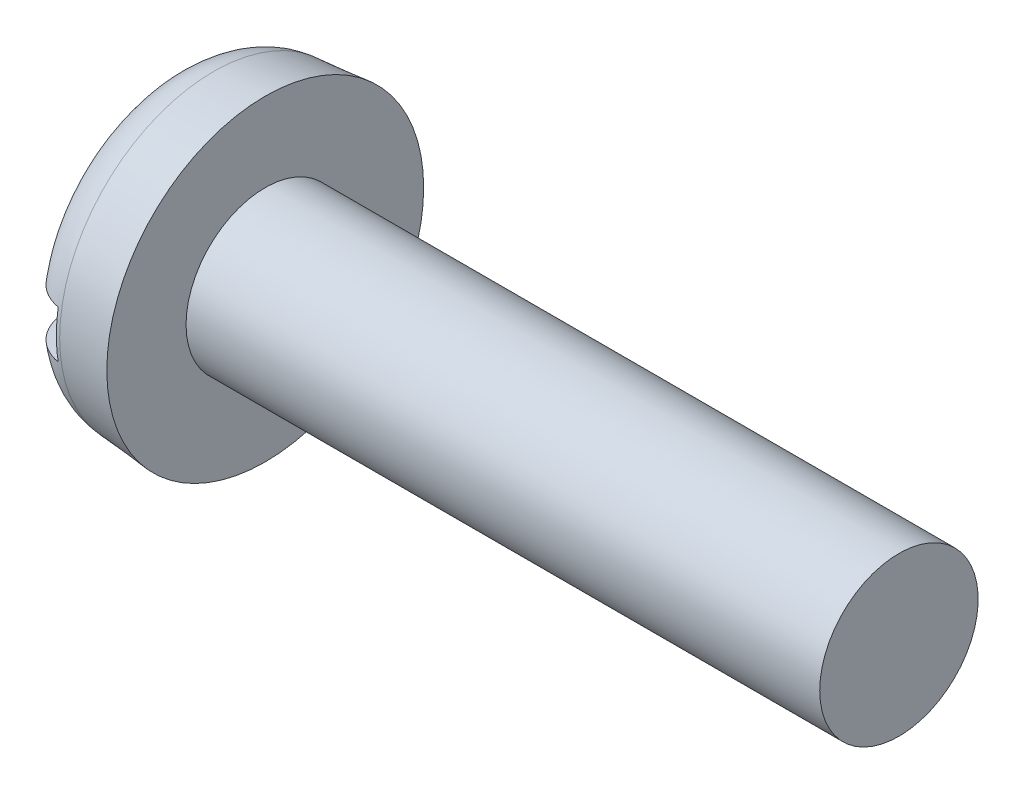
from build123d import *

# Parameters (mm, degrees)
FILLET2_R  = 1.2
SKETCH2_W  = 8
SKETCH2_H  = 1.2
SLOT_DEPTH = 1


with BuildPart() as part:
    # BodySke → Base-Revolve (revolve)
    with BuildSketch(Plane.XY, mode=Mode.PRIVATE) as base_revolve_sk:
        Polygon((2.4, 2), (2.4, 4), (0, 3.790027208), (0, 0), (18.4, 0), (18.4, 2), align=None)
    revolve(base_revolve_sk.sketch.rotate(Axis((-25.4, 0, 0), (1, 0, 0)), 90), axis=Axis((-25.4, 0, 0), (1, 0, 0)))

    # Fillet2
    fillet2_edges = [part.edges().sort_by_distance(p)[0] for p in [
        (0, 0, -3.790027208),
    ]]
    fillet(fillet2_edges, radius=FILLET2_R)

    # Sketch2 → Slot (cut)
    with BuildSketch(Plane(origin=(0, 0, 0), x_dir=(0, 0, -1), z_dir=(1, 0, 0))):
        Rectangle(SKETCH2_W, SKETCH2_H)
    extrude(amount=SLOT_DEPTH, mode=Mode.SUBTRACT)


solid = part.part
